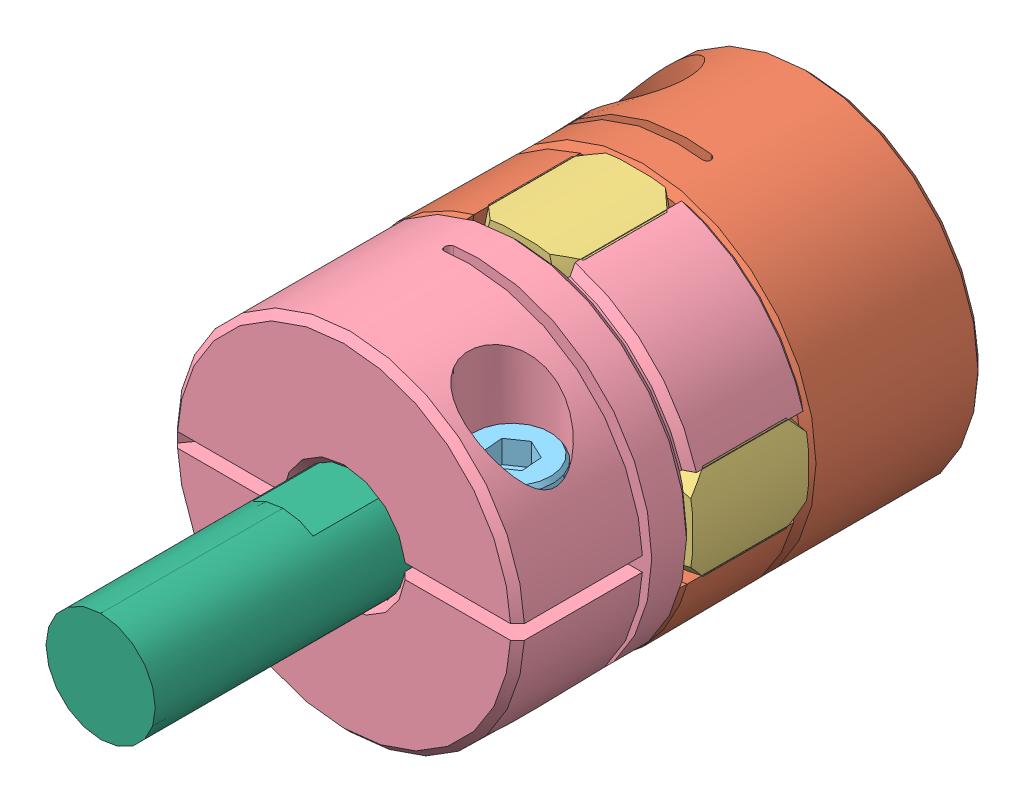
SolidWorks assembly Ruland_d19-8-6.SLDASM, configuration Default (file format 13000). Lengths in mm.
Overall size (23.56 23.56 39.01).
8 component instances, 6 part files, 8 mates.
Components (placement in the parent):
- MJC19-8-A-1: MJC19-8-A.SLDASM [Default] at (10.5286 6.8355 6.4824) size (19.05 19.05 16.89)
  - MJC19-8-A_Vis-1: MJC19-8-A_Vis.SLDPRT [Default] at origin size (4.5 10.5 4.5)
  - MJC19-8-A-1: MJC19-8-A.SLDPRT [Default] at origin size (19.05 19.05 16.89)
- JD12-19-1: JD12-19.SLDPRT [Default] at (15.1658 11.6972 13.5594) x (-0.707107 0.707107 0) z (0 0 -1) size (16.66 16.66 7.87)
- MJC19-6-A-2: MJC19-6-A.SLDASM [Default] at (19.8029 6.8355 20.6365) x (-1 0 0) z (0 0 -1) size (19.05 19.05 16.89)
  - MJC19-6-A-1: MJC19-6-A.SLDPRT [Default] at origin size (19.05 19.05 16.89)
  - MJC19-6-A_Vis-1: MJC19-6-A_Vis.SLDPRT [Default] at origin size (4.5 10.5 4.5)
- GPX26_1-1: GPX26_1.SLDPRT [Default] at (15.1658 11.6972 41.797) x (0 0 1) z (0.994522 0.104528 0) size (22 6 6)
Mates (geometry in assembly coordinates):
- Coaxiale6: concentric anti-aligned: cylinder of MJC19-8-A-1/MJC19-8-A-1 through (15.1658 11.6972 10.3844) axis (0 0 -1) radius 4; cylinder of JD12-19-1 through (15.1658 11.6972 10.0034) axis (0 0 1) radius 4.7625
- Coïncidente1: coincident anti-aligned: plane of MJC19-8-A-1/MJC19-8-A-1 through (15.1658 11.6972 10.3844) normal (0 0 1); plane of JD12-19-1 through (15.1658 11.6972 10.3844) normal (0 0 -1)
- Coaxiale7: concentric aligned: cylinder of MJC19-8-A-1/MJC19-8-A-1 through (21.9009 18.4324 19.3321) axis (0 0 -1) radius 9.5758; cylinder of JD12-19-1 through (21.9009 18.4324 17.1154) axis (0 0 -1) radius 9.6672
- Coaxiale8: concentric aligned: cylinder of JD12-19-1 through (15.1658 11.6972 10.0034) axis (0 0 1) radius 4.7625; cylinder of MJC19-6-A-2/MJC19-6-A-1 through (15.1658 11.6972 16.7344) axis (0 0 1) radius 2.9997
- Coaxiale9: concentric anti-aligned: cylinder of JD12-19-1 through (8.4306 18.4324 17.1154) axis (0 0 -1) radius 9.6672; cylinder of MJC19-6-A-2/MJC19-6-A-1 through (8.4306 18.4324 7.7867) axis (0 0 1) radius 9.5758
- Coïncidente2: coincident anti-aligned: plane of JD12-19-1 through (15.1658 11.6972 16.7344) normal (0 0 1); plane of MJC19-6-A-2/MJC19-6-A-1 through (15.1658 11.6972 16.7344) normal (0 0 -1)
- Coaxiale10: concentric: cylinder of MJC19-6-A-2/MJC19-6-A-1 through (15.1658 11.6972 16.7344) axis (0 0 1) radius 2.9997; cylinder of GPX26_1-1 through (15.1658 11.6972 28.747) axis (0 0 -1) radius 3
- Parallèle1: parallel aligned: plane of MJC19-6-A-2/MJC19-6-A-1 through (46.2808 11.3004 19.4014) normal (0 1 0); plane of GPX26_1-1 through (15.1658 14.1972 23.747) normal (0 1 0)
